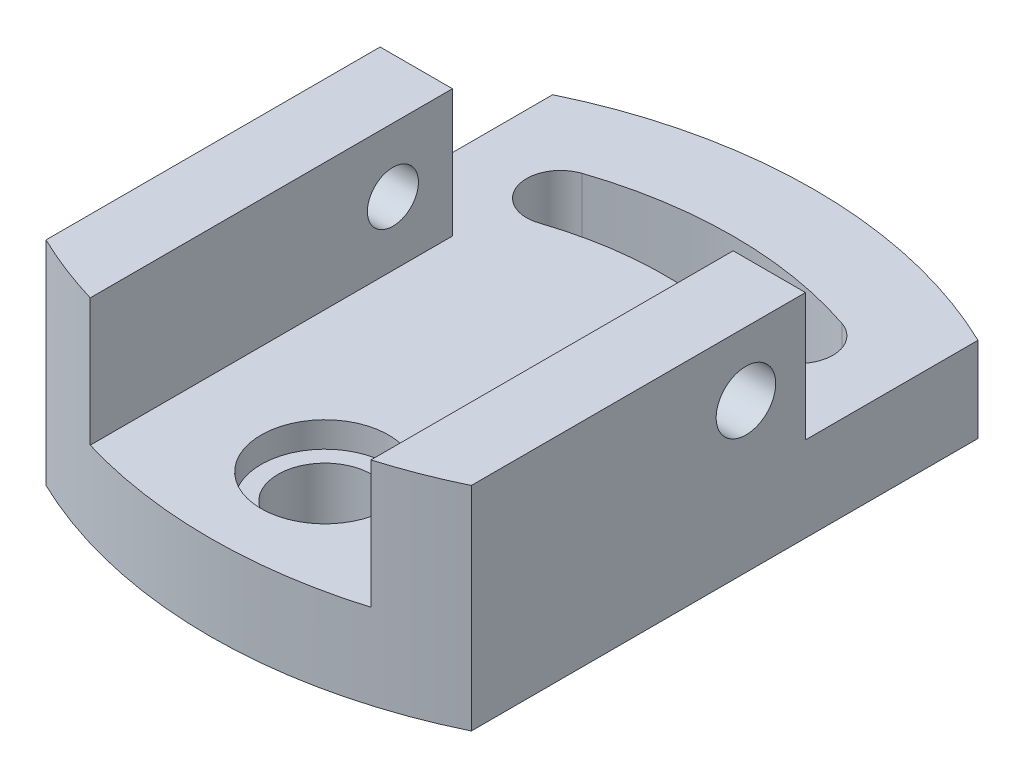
ISO-10303-21;
HEADER;
FILE_DESCRIPTION(('STEP AP214'),'2;1');
FILE_NAME('part.step','',(''),(''),'','','');
FILE_SCHEMA(('AUTOMOTIVE_DESIGN { 1 0 10303 214 1 1 1 1 }'));
ENDSEC;
DATA;
#1=APPLICATION_CONTEXT('core data for automotive mechanical design processes');
#2=APPLICATION_PROTOCOL_DEFINITION('international standard','automotive_design',2000,#1);
#3=PRODUCT_CONTEXT('',#1,'mechanical');
#4=PRODUCT('Part','Part','',(#3));
#5=PRODUCT_RELATED_PRODUCT_CATEGORY('part','',(#4));
#6=PRODUCT_DEFINITION_FORMATION('','',#4);
#7=PRODUCT_DEFINITION_CONTEXT('part definition',#1,'design');
#8=PRODUCT_DEFINITION('design','',#6,#7);
#9=PRODUCT_DEFINITION_SHAPE('','',#8);
#10=(LENGTH_UNIT() NAMED_UNIT(*) SI_UNIT(.MILLI.,.METRE.));
#11=(NAMED_UNIT(*) PLANE_ANGLE_UNIT() SI_UNIT($,.RADIAN.));
#12=(NAMED_UNIT(*) SI_UNIT($,.STERADIAN.) SOLID_ANGLE_UNIT());
#13=UNCERTAINTY_MEASURE_WITH_UNIT(LENGTH_MEASURE(1.E-05),#10,'distance_accuracy_value','');
#14=(GEOMETRIC_REPRESENTATION_CONTEXT(3) GLOBAL_UNCERTAINTY_ASSIGNED_CONTEXT((#13)) GLOBAL_UNIT_ASSIGNED_CONTEXT((#10,
#11,#12)) REPRESENTATION_CONTEXT('',''));
#15=CARTESIAN_POINT('',(0.,0.,0.));
#16=DIRECTION('',(0.,0.,1.));
#17=DIRECTION('',(1.,0.,0.));
#18=AXIS2_PLACEMENT_3D('',#15,#16,#17);
#19=CARTESIAN_POINT('',(-33.,20.,-71.001));
#20=DIRECTION('',(0.,-1.,0.));
#21=DIRECTION('',(0.,0.,-1.));
#22=AXIS2_PLACEMENT_3D('',#19,#20,#21);
#23=PLANE('',#22);
#24=DIRECTION('',(0.,0.,1.));
#25=VECTOR('',#24,1.);
#26=CARTESIAN_POINT('',(-33.,20.,-71.001));
#27=LINE('',#26,#25);
#28=CARTESIAN_POINT('',(-33.,20.,-19.));
#29=VERTEX_POINT('',#28);
#30=CARTESIAN_POINT('',(-33.,20.,66.1635148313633));
#31=VERTEX_POINT('',#30);
#32=EDGE_CURVE('E275',#29,#31,#27,.T.);
#33=ORIENTED_EDGE('',*,*,#32,.T.);
#34=CARTESIAN_POINT('',(0.,20.,-44.));
#35=DIRECTION('',(0.,-1.,0.));
#36=DIRECTION('',(0.,0.,-1.));
#37=AXIS2_PLACEMENT_3D('',#34,#35,#36);
#38=CIRCLE('',#37,115.);
#39=CARTESIAN_POINT('',(33.,20.,66.1635148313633));
#40=VERTEX_POINT('',#39);
#41=EDGE_CURVE('E214',#40,#31,#38,.T.);
#42=ORIENTED_EDGE('',*,*,#41,.F.);
#43=DIRECTION('',(0.,0.,1.));
#44=VECTOR('',#43,1.);
#45=CARTESIAN_POINT('',(33.,20.,-71.001));
#46=LINE('',#45,#44);
#47=CARTESIAN_POINT('',(33.,20.,-19.));
#48=VERTEX_POINT('',#47);
#49=EDGE_CURVE('E279',#48,#40,#46,.T.);
#50=ORIENTED_EDGE('',*,*,#49,.F.);
#51=DIRECTION('',(1.,0.,0.));
#52=VECTOR('',#51,1.);
#53=CARTESIAN_POINT('',(-50.,20.,-19.));
#54=LINE('',#53,#52);
#55=CARTESIAN_POINT('',(50.,20.,-19.));
#56=VERTEX_POINT('',#55);
#57=EDGE_CURVE('E256',#48,#56,#54,.T.);
#58=ORIENTED_EDGE('',*,*,#57,.T.);
#59=DIRECTION('',(0.,0.,-1.));
#60=VECTOR('',#59,1.);
#61=CARTESIAN_POINT('',(50.,20.,-71.));
#62=LINE('',#61,#60);
#63=CARTESIAN_POINT('',(50.,20.,-59.5615758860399));
#64=VERTEX_POINT('',#63);
#65=EDGE_CURVE('E264',#56,#64,#62,.T.);
#66=ORIENTED_EDGE('',*,*,#65,.T.);
#67=CARTESIAN_POINT('',(0.,20.,44.));
#68=DIRECTION('',(0.,-1.,0.));
#69=DIRECTION('',(0.,0.,-1.));
#70=AXIS2_PLACEMENT_3D('',#67,#68,#69);
#71=CIRCLE('',#70,115.);
#72=CARTESIAN_POINT('',(-50.,20.,-59.5615758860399));
#73=VERTEX_POINT('',#72);
#74=EDGE_CURVE('E184',#64,#73,#71,.F.);
#75=ORIENTED_EDGE('',*,*,#74,.T.);
#76=DIRECTION('',(0.,0.,1.));
#77=VECTOR('',#76,1.);
#78=CARTESIAN_POINT('',(-50.,20.,-71.));
#79=LINE('',#78,#77);
#80=CARTESIAN_POINT('',(-50.,20.,-19.));
#81=VERTEX_POINT('',#80);
#82=EDGE_CURVE('E261',#73,#81,#79,.T.);
#83=ORIENTED_EDGE('',*,*,#82,.T.);
#84=EDGE_CURVE('E257',#81,#29,#54,.T.);
#85=ORIENTED_EDGE('',*,*,#84,.T.);
#86=EDGE_LOOP('',(#33,#42,#50,#58,#66,#75,#83,#85));
#87=FACE_BOUND('',#86,.T.);
#88=CARTESIAN_POINT('',(0.,20.,44.));
#89=DIRECTION('',(0.,1.,0.));
#90=DIRECTION('',(0.,0.,1.));
#91=AXIS2_PLACEMENT_3D('',#88,#89,#90);
#92=CIRCLE('',#91,96.);
#93=CARTESIAN_POINT('',(30.5454545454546,20.,-47.0108521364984));
#94=VERTEX_POINT('',#93);
#95=CARTESIAN_POINT('',(-30.5454545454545,20.,-47.0108521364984));
#96=VERTEX_POINT('',#95);
#97=EDGE_CURVE('E232',#94,#96,#92,.T.);
#98=ORIENTED_EDGE('',*,*,#97,.F.);
#99=CARTESIAN_POINT('',(28.,20.,-39.4266144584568));
#100=DIRECTION('',(0.,1.,0.));
#101=DIRECTION('',(0.,0.,1.));
#102=AXIS2_PLACEMENT_3D('',#99,#100,#101);
#103=CIRCLE('',#102,8.00000000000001);
#104=CARTESIAN_POINT('',(25.4545454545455,20.,-31.8423767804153));
#105=VERTEX_POINT('',#104);
#106=EDGE_CURVE('E230',#105,#94,#103,.T.);
#107=ORIENTED_EDGE('',*,*,#106,.F.);
#108=CARTESIAN_POINT('',(0.,20.,44.));
#109=DIRECTION('',(0.,-1.,0.));
#110=DIRECTION('',(0.,0.,1.));
#111=AXIS2_PLACEMENT_3D('',#108,#109,#110);
#112=CIRCLE('',#111,80.);
#113=CARTESIAN_POINT('',(-25.4545454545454,20.,-31.8423767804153));
#114=VERTEX_POINT('',#113);
#115=EDGE_CURVE('E238',#114,#105,#112,.T.);
#116=ORIENTED_EDGE('',*,*,#115,.F.);
#117=CARTESIAN_POINT('',(-28.,20.,-39.4266144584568));
#118=DIRECTION('',(0.,1.,0.));
#119=DIRECTION('',(0.,0.,1.));
#120=AXIS2_PLACEMENT_3D('',#117,#118,#119);
#121=CIRCLE('',#120,8.00000000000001);
#122=EDGE_CURVE('E235',#96,#114,#121,.T.);
#123=ORIENTED_EDGE('',*,*,#122,.F.);
#124=EDGE_LOOP('',(#98,#107,#116,#123));
#125=FACE_BOUND('',#124,.T.);
#126=CARTESIAN_POINT('',(0.,20.,44.));
#127=DIRECTION('',(0.,1.,0.));
#128=DIRECTION('',(0.,0.,1.));
#129=AXIS2_PLACEMENT_3D('',#126,#127,#128);
#130=CIRCLE('',#129,15.);
#131=CARTESIAN_POINT('',(0.,20.,59.));
#132=VERTEX_POINT('',#131);
#133=EDGE_CURVE('E188',#132,#132,#130,.T.);
#134=ORIENTED_EDGE('',*,*,#133,.F.);
#135=EDGE_LOOP('',(#134));
#136=FACE_BOUND('',#135,.T.);
#137=ADVANCED_FACE('F51',(#87,#125,#136),#23,.F.);
#138=CARTESIAN_POINT('',(0.,0.,0.));
#139=DIRECTION('',(0.,1.,0.));
#140=DIRECTION('',(0.,0.,1.));
#141=AXIS2_PLACEMENT_3D('',#138,#139,#140);
#142=PLANE('',#141);
#143=CARTESIAN_POINT('',(0.,0.,44.));
#144=DIRECTION('',(0.,1.,0.));
#145=DIRECTION('',(0.,0.,1.));
#146=AXIS2_PLACEMENT_3D('',#143,#144,#145);
#147=CIRCLE('',#146,11.);
#148=CARTESIAN_POINT('',(0.,0.,55.));
#149=VERTEX_POINT('',#148);
#150=EDGE_CURVE('E208',#149,#149,#147,.T.);
#151=ORIENTED_EDGE('',*,*,#150,.T.);
#152=EDGE_LOOP('',(#151));
#153=FACE_BOUND('',#152,.T.);
#154=CARTESIAN_POINT('',(0.,0.,44.));
#155=DIRECTION('',(0.,1.,0.));
#156=DIRECTION('',(0.,0.,1.));
#157=AXIS2_PLACEMENT_3D('',#154,#155,#156);
#158=CIRCLE('',#157,80.);
#159=CARTESIAN_POINT('',(25.4545454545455,0.,-31.8423767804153));
#160=VERTEX_POINT('',#159);
#161=CARTESIAN_POINT('',(-25.4545454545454,0.,-31.8423767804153));
#162=VERTEX_POINT('',#161);
#163=EDGE_CURVE('E224',#160,#162,#158,.T.);
#164=ORIENTED_EDGE('',*,*,#163,.F.);
#165=CARTESIAN_POINT('',(28.,0.,-39.4266144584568));
#166=DIRECTION('',(0.,1.,0.));
#167=DIRECTION('',(0.,0.,1.));
#168=AXIS2_PLACEMENT_3D('',#165,#166,#167);
#169=CIRCLE('',#168,8.00000000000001);
#170=CARTESIAN_POINT('',(30.5454545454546,0.,-47.0108521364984));
#171=VERTEX_POINT('',#170);
#172=EDGE_CURVE('E227',#171,#160,#169,.F.);
#173=ORIENTED_EDGE('',*,*,#172,.F.);
#174=CARTESIAN_POINT('',(0.,0.,44.));
#175=DIRECTION('',(0.,1.,0.));
#176=DIRECTION('',(0.,0.,1.));
#177=AXIS2_PLACEMENT_3D('',#174,#175,#176);
#178=CIRCLE('',#177,96.);
#179=CARTESIAN_POINT('',(-30.5454545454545,0.,-47.0108521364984));
#180=VERTEX_POINT('',#179);
#181=EDGE_CURVE('E244',#180,#171,#178,.F.);
#182=ORIENTED_EDGE('',*,*,#181,.F.);
#183=CARTESIAN_POINT('',(-28.,0.,-39.4266144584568));
#184=DIRECTION('',(0.,1.,0.));
#185=DIRECTION('',(0.,0.,1.));
#186=AXIS2_PLACEMENT_3D('',#183,#184,#185);
#187=CIRCLE('',#186,8.00000000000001);
#188=EDGE_CURVE('E222',#162,#180,#187,.F.);
#189=ORIENTED_EDGE('',*,*,#188,.F.);
#190=EDGE_LOOP('',(#164,#173,#182,#189));
#191=FACE_BOUND('',#190,.T.);
#192=CARTESIAN_POINT('',(0.,0.,-44.));
#193=DIRECTION('',(0.,1.,0.));
#194=DIRECTION('',(0.,0.,1.));
#195=AXIS2_PLACEMENT_3D('',#192,#193,#194);
#196=CIRCLE('',#195,115.);
#197=CARTESIAN_POINT('',(-50.,0.,59.5615758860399));
#198=VERTEX_POINT('',#197);
#199=CARTESIAN_POINT('',(50.,0.,59.5615758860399));
#200=VERTEX_POINT('',#199);
#201=EDGE_CURVE('E153',#198,#200,#196,.T.);
#202=ORIENTED_EDGE('',*,*,#201,.F.);
#203=DIRECTION('',(0.,0.,1.));
#204=VECTOR('',#203,1.);
#205=CARTESIAN_POINT('',(-50.,0.,71.));
#206=LINE('',#205,#204);
#207=CARTESIAN_POINT('',(-50.,0.,-59.5615758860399));
#208=VERTEX_POINT('',#207);
#209=EDGE_CURVE('E158',#208,#198,#206,.T.);
#210=ORIENTED_EDGE('',*,*,#209,.F.);
#211=CARTESIAN_POINT('',(0.,0.,44.));
#212=DIRECTION('',(0.,1.,0.));
#213=DIRECTION('',(0.,0.,1.));
#214=AXIS2_PLACEMENT_3D('',#211,#212,#213);
#215=CIRCLE('',#214,115.);
#216=CARTESIAN_POINT('',(50.,0.,-59.5615758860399));
#217=VERTEX_POINT('',#216);
#218=EDGE_CURVE('E219',#208,#217,#215,.F.);
#219=ORIENTED_EDGE('',*,*,#218,.T.);
#220=DIRECTION('',(0.,0.,-1.));
#221=VECTOR('',#220,1.);
#222=CARTESIAN_POINT('',(50.,0.,71.));
#223=LINE('',#222,#221);
#224=EDGE_CURVE('E159',#200,#217,#223,.T.);
#225=ORIENTED_EDGE('',*,*,#224,.F.);
#226=EDGE_LOOP('',(#202,#210,#219,#225));
#227=FACE_BOUND('',#226,.T.);
#228=ADVANCED_FACE('F155',(#153,#191,#227),#142,.F.);
#229=CARTESIAN_POINT('',(0.,50.,0.));
#230=DIRECTION('',(0.,1.,0.));
#231=DIRECTION('',(0.,0.,1.));
#232=AXIS2_PLACEMENT_3D('',#229,#230,#231);
#233=PLANE('',#232);
#234=DIRECTION('',(0.,0.,1.));
#235=VECTOR('',#234,1.);
#236=CARTESIAN_POINT('',(-50.,50.,71.));
#237=LINE('',#236,#235);
#238=CARTESIAN_POINT('',(-50.,50.,-19.));
#239=VERTEX_POINT('',#238);
#240=CARTESIAN_POINT('',(-50.,50.,59.5615758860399));
#241=VERTEX_POINT('',#240);
#242=EDGE_CURVE('E175',#239,#241,#237,.T.);
#243=ORIENTED_EDGE('',*,*,#242,.T.);
#244=CARTESIAN_POINT('',(0.,50.,-44.));
#245=DIRECTION('',(0.,1.,0.));
#246=DIRECTION('',(0.,0.,1.));
#247=AXIS2_PLACEMENT_3D('',#244,#245,#246);
#248=CIRCLE('',#247,115.);
#249=CARTESIAN_POINT('',(-33.,50.,66.1635148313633));
#250=VERTEX_POINT('',#249);
#251=EDGE_CURVE('E167',#241,#250,#248,.T.);
#252=ORIENTED_EDGE('',*,*,#251,.T.);
#253=DIRECTION('',(0.,0.,1.));
#254=VECTOR('',#253,1.);
#255=CARTESIAN_POINT('',(-33.,50.,-71.001));
#256=LINE('',#255,#254);
#257=CARTESIAN_POINT('',(-33.,50.,-19.));
#258=VERTEX_POINT('',#257);
#259=EDGE_CURVE('E173',#258,#250,#256,.T.);
#260=ORIENTED_EDGE('',*,*,#259,.F.);
#261=DIRECTION('',(1.,0.,0.));
#262=VECTOR('',#261,1.);
#263=CARTESIAN_POINT('',(-50.,50.,-19.));
#264=LINE('',#263,#262);
#265=EDGE_CURVE('E254',#239,#258,#264,.T.);
#266=ORIENTED_EDGE('',*,*,#265,.F.);
#267=EDGE_LOOP('',(#243,#252,#260,#266));
#268=FACE_BOUND('',#267,.T.);
#269=ADVANCED_FACE('F310',(#268),#233,.T.);
#270=CARTESIAN_POINT('',(-50.,50.,71.));
#271=DIRECTION('',(1.,0.,0.));
#272=DIRECTION('',(0.,0.,-1.));
#273=AXIS2_PLACEMENT_3D('',#270,#271,#272);
#274=PLANE('',#273);
#275=CARTESIAN_POINT('',(-50.,35.,-5.));
#276=DIRECTION('',(-1.,0.,0.));
#277=DIRECTION('',(0.,0.,1.));
#278=AXIS2_PLACEMENT_3D('',#275,#276,#277);
#279=CIRCLE('',#278,6.);
#280=CARTESIAN_POINT('',(-50.,35.,0.999999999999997));
#281=VERTEX_POINT('',#280);
#282=EDGE_CURVE('E200',#281,#281,#279,.T.);
#283=ORIENTED_EDGE('',*,*,#282,.F.);
#284=EDGE_LOOP('',(#283));
#285=FACE_BOUND('',#284,.T.);
#286=DIRECTION('',(0.,1.,0.));
#287=VECTOR('',#286,1.);
#288=CARTESIAN_POINT('',(-50.,0.,59.5615758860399));
#289=LINE('',#288,#287);
#290=EDGE_CURVE('E164',#198,#241,#289,.T.);
#291=ORIENTED_EDGE('',*,*,#290,.T.);
#292=ORIENTED_EDGE('',*,*,#242,.F.);
#293=DIRECTION('',(0.,1.,0.));
#294=VECTOR('',#293,1.);
#295=CARTESIAN_POINT('',(-50.,-92.712022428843,-19.));
#296=LINE('',#295,#294);
#297=EDGE_CURVE('E263',#81,#239,#296,.T.);
#298=ORIENTED_EDGE('',*,*,#297,.F.);
#299=ORIENTED_EDGE('',*,*,#82,.F.);
#300=DIRECTION('',(0.,1.,0.));
#301=VECTOR('',#300,1.);
#302=CARTESIAN_POINT('',(-50.,0.,-59.5615758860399));
#303=LINE('',#302,#301);
#304=EDGE_CURVE('E76',#208,#73,#303,.T.);
#305=ORIENTED_EDGE('',*,*,#304,.F.);
#306=ORIENTED_EDGE('',*,*,#209,.T.);
#307=EDGE_LOOP('',(#291,#292,#298,#299,#305,#306));
#308=FACE_BOUND('',#307,.T.);
#309=ADVANCED_FACE('F53',(#285,#308),#274,.F.);
#310=CARTESIAN_POINT('',(-33.,50.,-71.001));
#311=DIRECTION('',(-1.,0.,0.));
#312=DIRECTION('',(0.,-1.,0.));
#313=AXIS2_PLACEMENT_3D('',#310,#311,#312);
#314=PLANE('',#313);
#315=CARTESIAN_POINT('',(-33.,35.,-5.));
#316=DIRECTION('',(-1.,0.,0.));
#317=DIRECTION('',(0.,-1.,0.));
#318=AXIS2_PLACEMENT_3D('',#315,#316,#317);
#319=CIRCLE('',#318,6.);
#320=CARTESIAN_POINT('',(-33.,29.,-5.));
#321=VERTEX_POINT('',#320);
#322=EDGE_CURVE('E55',#321,#321,#319,.T.);
#323=ORIENTED_EDGE('',*,*,#322,.T.);
#324=EDGE_LOOP('',(#323));
#325=FACE_BOUND('',#324,.T.);
#326=DIRECTION('',(0.,1.,0.));
#327=VECTOR('',#326,1.);
#328=CARTESIAN_POINT('',(-33.,0.,66.1635148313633));
#329=LINE('',#328,#327);
#330=EDGE_CURVE('E12',#31,#250,#329,.T.);
#331=ORIENTED_EDGE('',*,*,#330,.F.);
#332=ORIENTED_EDGE('',*,*,#32,.F.);
#333=DIRECTION('',(0.,1.,0.));
#334=VECTOR('',#333,1.);
#335=CARTESIAN_POINT('',(-33.,50.,-19.));
#336=LINE('',#335,#334);
#337=EDGE_CURVE('E273',#29,#258,#336,.T.);
#338=ORIENTED_EDGE('',*,*,#337,.T.);
#339=ORIENTED_EDGE('',*,*,#259,.T.);
#340=EDGE_LOOP('',(#331,#332,#338,#339));
#341=FACE_BOUND('',#340,.T.);
#342=ADVANCED_FACE('F308',(#325,#341),#314,.F.);
#343=CARTESIAN_POINT('',(50.,50.,71.));
#344=DIRECTION('',(-1.,0.,0.));
#345=DIRECTION('',(0.,0.,1.));
#346=AXIS2_PLACEMENT_3D('',#343,#344,#345);
#347=PLANE('',#346);
#348=CARTESIAN_POINT('',(50.,35.,-5.));
#349=DIRECTION('',(1.,0.,0.));
#350=DIRECTION('',(0.,0.,-1.));
#351=AXIS2_PLACEMENT_3D('',#348,#349,#350);
#352=CIRCLE('',#351,7.);
#353=CARTESIAN_POINT('',(50.,35.,-12.));
#354=VERTEX_POINT('',#353);
#355=EDGE_CURVE('E189',#354,#354,#352,.T.);
#356=ORIENTED_EDGE('',*,*,#355,.F.);
#357=EDGE_LOOP('',(#356));
#358=FACE_BOUND('',#357,.T.);
#359=DIRECTION('',(0.,1.,0.));
#360=VECTOR('',#359,1.);
#361=CARTESIAN_POINT('',(50.,0.,59.5615758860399));
#362=LINE('',#361,#360);
#363=CARTESIAN_POINT('',(50.,50.,59.5615758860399));
#364=VERTEX_POINT('',#363);
#365=EDGE_CURVE('E161',#200,#364,#362,.T.);
#366=ORIENTED_EDGE('',*,*,#365,.F.);
#367=ORIENTED_EDGE('',*,*,#224,.T.);
#368=DIRECTION('',(0.,1.,0.));
#369=VECTOR('',#368,1.);
#370=CARTESIAN_POINT('',(50.,0.,-59.5615758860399));
#371=LINE('',#370,#369);
#372=EDGE_CURVE('E216',#217,#64,#371,.T.);
#373=ORIENTED_EDGE('',*,*,#372,.T.);
#374=ORIENTED_EDGE('',*,*,#65,.F.);
#375=DIRECTION('',(0.,1.,0.));
#376=VECTOR('',#375,1.);
#377=CARTESIAN_POINT('',(50.,-92.712022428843,-19.));
#378=LINE('',#377,#376);
#379=CARTESIAN_POINT('',(50.,50.,-19.));
#380=VERTEX_POINT('',#379);
#381=EDGE_CURVE('E260',#56,#380,#378,.T.);
#382=ORIENTED_EDGE('',*,*,#381,.T.);
#383=DIRECTION('',(0.,0.,-1.));
#384=VECTOR('',#383,1.);
#385=CARTESIAN_POINT('',(50.,50.,71.));
#386=LINE('',#385,#384);
#387=EDGE_CURVE('E181',#364,#380,#386,.T.);
#388=ORIENTED_EDGE('',*,*,#387,.F.);
#389=EDGE_LOOP('',(#366,#367,#373,#374,#382,#388));
#390=FACE_BOUND('',#389,.T.);
#391=ADVANCED_FACE('F296',(#358,#390),#347,.F.);
#392=DIRECTION('',(0.,0.,1.));
#393=VECTOR('',#392,1.);
#394=CARTESIAN_POINT('',(33.,50.,-71.001));
#395=LINE('',#394,#393);
#396=CARTESIAN_POINT('',(33.,50.,-19.));
#397=VERTEX_POINT('',#396);
#398=CARTESIAN_POINT('',(33.,50.,66.1635148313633));
#399=VERTEX_POINT('',#398);
#400=EDGE_CURVE('E178',#397,#399,#395,.T.);
#401=ORIENTED_EDGE('',*,*,#400,.T.);
#402=CARTESIAN_POINT('',(0.,50.,-44.));
#403=DIRECTION('',(0.,1.,0.));
#404=DIRECTION('',(0.,0.,1.));
#405=AXIS2_PLACEMENT_3D('',#402,#403,#404);
#406=CIRCLE('',#405,115.);
#407=EDGE_CURVE('E68',#399,#364,#406,.T.);
#408=ORIENTED_EDGE('',*,*,#407,.T.);
#409=ORIENTED_EDGE('',*,*,#387,.T.);
#410=EDGE_CURVE('E253',#397,#380,#264,.T.);
#411=ORIENTED_EDGE('',*,*,#410,.F.);
#412=EDGE_LOOP('',(#401,#408,#409,#411));
#413=FACE_BOUND('',#412,.T.);
#414=ADVANCED_FACE('F289',(#413),#233,.T.);
#415=CARTESIAN_POINT('',(33.,50.,-71.001));
#416=DIRECTION('',(1.,0.,0.));
#417=DIRECTION('',(0.,1.,0.));
#418=AXIS2_PLACEMENT_3D('',#415,#416,#417);
#419=PLANE('',#418);
#420=CARTESIAN_POINT('',(33.,35.,-5.));
#421=DIRECTION('',(1.,0.,0.));
#422=DIRECTION('',(0.,1.,0.));
#423=AXIS2_PLACEMENT_3D('',#420,#421,#422);
#424=CIRCLE('',#423,7.);
#425=CARTESIAN_POINT('',(33.,42.,-5.));
#426=VERTEX_POINT('',#425);
#427=EDGE_CURVE('E186',#426,#426,#424,.T.);
#428=ORIENTED_EDGE('',*,*,#427,.T.);
#429=EDGE_LOOP('',(#428));
#430=FACE_BOUND('',#429,.T.);
#431=DIRECTION('',(0.,1.,0.));
#432=VECTOR('',#431,1.);
#433=CARTESIAN_POINT('',(33.,0.,66.1635148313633));
#434=LINE('',#433,#432);
#435=EDGE_CURVE('E60',#399,#40,#434,.F.);
#436=ORIENTED_EDGE('',*,*,#435,.F.);
#437=ORIENTED_EDGE('',*,*,#400,.F.);
#438=DIRECTION('',(0.,-1.,0.));
#439=VECTOR('',#438,1.);
#440=CARTESIAN_POINT('',(33.,50.,-19.));
#441=LINE('',#440,#439);
#442=EDGE_CURVE('E270',#397,#48,#441,.T.);
#443=ORIENTED_EDGE('',*,*,#442,.T.);
#444=ORIENTED_EDGE('',*,*,#49,.T.);
#445=EDGE_LOOP('',(#436,#437,#443,#444));
#446=FACE_BOUND('',#445,.T.);
#447=ADVANCED_FACE('F303',(#430,#446),#419,.F.);
#448=CARTESIAN_POINT('',(-50.,-92.712022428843,-19.));
#449=DIRECTION('',(0.,0.,1.));
#450=DIRECTION('',(1.,0.,0.));
#451=AXIS2_PLACEMENT_3D('',#448,#449,#450);
#452=PLANE('',#451);
#453=ORIENTED_EDGE('',*,*,#410,.T.);
#454=ORIENTED_EDGE('',*,*,#381,.F.);
#455=ORIENTED_EDGE('',*,*,#57,.F.);
#456=ORIENTED_EDGE('',*,*,#442,.F.);
#457=EDGE_LOOP('',(#453,#454,#455,#456));
#458=FACE_BOUND('',#457,.T.);
#459=ADVANCED_FACE('F294',(#458),#452,.F.);
#460=ORIENTED_EDGE('',*,*,#84,.F.);
#461=ORIENTED_EDGE('',*,*,#297,.T.);
#462=ORIENTED_EDGE('',*,*,#265,.T.);
#463=ORIENTED_EDGE('',*,*,#337,.F.);
#464=EDGE_LOOP('',(#460,#461,#462,#463));
#465=FACE_BOUND('',#464,.T.);
#466=ADVANCED_FACE('F313',(#465),#452,.F.);
#467=CARTESIAN_POINT('',(28.,-0.001000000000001,-39.4266144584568));
#468=DIRECTION('',(0.,1.,0.));
#469=DIRECTION('',(0.,0.,1.));
#470=AXIS2_PLACEMENT_3D('',#467,#468,#469);
#471=CYLINDRICAL_SURFACE('',#470,8.00000000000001);
#472=ORIENTED_EDGE('',*,*,#172,.T.);
#473=DIRECTION('',(0.,1.,0.));
#474=VECTOR('',#473,1.);
#475=CARTESIAN_POINT('',(25.4545454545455,-0.001000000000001,-31.8423767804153));
#476=LINE('',#475,#474);
#477=EDGE_CURVE('E242',#160,#105,#476,.T.);
#478=ORIENTED_EDGE('',*,*,#477,.T.);
#479=ORIENTED_EDGE('',*,*,#106,.T.);
#480=DIRECTION('',(0.,1.,0.));
#481=VECTOR('',#480,1.);
#482=CARTESIAN_POINT('',(30.5454545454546,-0.001000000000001,-47.0108521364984));
#483=LINE('',#482,#481);
#484=EDGE_CURVE('E241',#171,#94,#483,.T.);
#485=ORIENTED_EDGE('',*,*,#484,.F.);
#486=EDGE_LOOP('',(#472,#478,#479,#485));
#487=FACE_BOUND('',#486,.T.);
#488=ADVANCED_FACE('F315',(#487),#471,.F.);
#489=CARTESIAN_POINT('',(0.,-0.001000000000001,44.));
#490=DIRECTION('',(0.,1.,0.));
#491=DIRECTION('',(0.,0.,1.));
#492=AXIS2_PLACEMENT_3D('',#489,#490,#491);
#493=CYLINDRICAL_SURFACE('',#492,80.);
#494=ORIENTED_EDGE('',*,*,#163,.T.);
#495=DIRECTION('',(0.,1.,0.));
#496=VECTOR('',#495,1.);
#497=CARTESIAN_POINT('',(-25.4545454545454,-0.001000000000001,-31.8423767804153));
#498=LINE('',#497,#496);
#499=EDGE_CURVE('E245',#162,#114,#498,.T.);
#500=ORIENTED_EDGE('',*,*,#499,.T.);
#501=ORIENTED_EDGE('',*,*,#115,.T.);
#502=ORIENTED_EDGE('',*,*,#477,.F.);
#503=EDGE_LOOP('',(#494,#500,#501,#502));
#504=FACE_BOUND('',#503,.T.);
#505=ADVANCED_FACE('F321',(#504),#493,.T.);
#506=CARTESIAN_POINT('',(-28.,-0.001000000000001,-39.4266144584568));
#507=DIRECTION('',(0.,1.,0.));
#508=DIRECTION('',(0.,0.,1.));
#509=AXIS2_PLACEMENT_3D('',#506,#507,#508);
#510=CYLINDRICAL_SURFACE('',#509,8.00000000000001);
#511=ORIENTED_EDGE('',*,*,#188,.T.);
#512=DIRECTION('',(0.,1.,0.));
#513=VECTOR('',#512,1.);
#514=CARTESIAN_POINT('',(-30.5454545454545,-0.001000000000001,-47.0108521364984));
#515=LINE('',#514,#513);
#516=EDGE_CURVE('E247',#180,#96,#515,.T.);
#517=ORIENTED_EDGE('',*,*,#516,.T.);
#518=ORIENTED_EDGE('',*,*,#122,.T.);
#519=ORIENTED_EDGE('',*,*,#499,.F.);
#520=EDGE_LOOP('',(#511,#517,#518,#519));
#521=FACE_BOUND('',#520,.T.);
#522=ADVANCED_FACE('F380',(#521),#510,.F.);
#523=CARTESIAN_POINT('',(0.,-0.001000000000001,44.));
#524=DIRECTION('',(0.,1.,0.));
#525=DIRECTION('',(0.,0.,1.));
#526=AXIS2_PLACEMENT_3D('',#523,#524,#525);
#527=CYLINDRICAL_SURFACE('',#526,96.);
#528=ORIENTED_EDGE('',*,*,#181,.T.);
#529=ORIENTED_EDGE('',*,*,#484,.T.);
#530=ORIENTED_EDGE('',*,*,#97,.T.);
#531=ORIENTED_EDGE('',*,*,#516,.F.);
#532=EDGE_LOOP('',(#528,#529,#530,#531));
#533=FACE_BOUND('',#532,.T.);
#534=ADVANCED_FACE('F390',(#533),#527,.F.);
#535=CARTESIAN_POINT('',(0.,0.,44.));
#536=DIRECTION('',(0.,1.,0.));
#537=DIRECTION('',(0.,0.,1.));
#538=AXIS2_PLACEMENT_3D('',#535,#536,#537);
#539=CYLINDRICAL_SURFACE('',#538,115.);
#540=ORIENTED_EDGE('',*,*,#74,.F.);
#541=ORIENTED_EDGE('',*,*,#372,.F.);
#542=ORIENTED_EDGE('',*,*,#218,.F.);
#543=ORIENTED_EDGE('',*,*,#304,.T.);
#544=EDGE_LOOP('',(#540,#541,#542,#543));
#545=FACE_BOUND('',#544,.T.);
#546=ADVANCED_FACE('F399',(#545),#539,.T.);
#547=CARTESIAN_POINT('',(0.,0.,-44.));
#548=DIRECTION('',(0.,1.,0.));
#549=DIRECTION('',(0.,0.,1.));
#550=AXIS2_PLACEMENT_3D('',#547,#548,#549);
#551=CYLINDRICAL_SURFACE('',#550,115.);
#552=ORIENTED_EDGE('',*,*,#41,.T.);
#553=ORIENTED_EDGE('',*,*,#330,.T.);
#554=ORIENTED_EDGE('',*,*,#251,.F.);
#555=ORIENTED_EDGE('',*,*,#290,.F.);
#556=ORIENTED_EDGE('',*,*,#201,.T.);
#557=ORIENTED_EDGE('',*,*,#365,.T.);
#558=ORIENTED_EDGE('',*,*,#407,.F.);
#559=ORIENTED_EDGE('',*,*,#435,.T.);
#560=EDGE_LOOP('',(#552,#553,#554,#555,#556,#557,#558,#559));
#561=FACE_BOUND('',#560,.T.);
#562=ADVANCED_FACE('F165',(#561),#551,.T.);
#563=CARTESIAN_POINT('',(0.,20.,44.));
#564=DIRECTION('',(0.,1.,0.));
#565=DIRECTION('',(0.,0.,1.));
#566=AXIS2_PLACEMENT_3D('',#563,#564,#565);
#567=CYLINDRICAL_SURFACE('',#566,11.);
#568=ORIENTED_EDGE('',*,*,#150,.F.);
#569=EDGE_LOOP('',(#568));
#570=FACE_BOUND('',#569,.T.);
#571=CARTESIAN_POINT('',(0.,14.,44.));
#572=DIRECTION('',(0.,1.,0.));
#573=DIRECTION('',(0.,0.,1.));
#574=AXIS2_PLACEMENT_3D('',#571,#572,#573);
#575=CIRCLE('',#574,11.);
#576=CARTESIAN_POINT('',(0.,14.,55.));
#577=VERTEX_POINT('',#576);
#578=EDGE_CURVE('E205',#577,#577,#575,.T.);
#579=ORIENTED_EDGE('',*,*,#578,.T.);
#580=EDGE_LOOP('',(#579));
#581=FACE_BOUND('',#580,.T.);
#582=ADVANCED_FACE('F454',(#570,#581),#567,.F.);
#583=CARTESIAN_POINT('',(11.,14.,44.));
#584=DIRECTION('',(0.,-1.,0.));
#585=DIRECTION('',(0.,0.,-1.));
#586=AXIS2_PLACEMENT_3D('',#583,#584,#585);
#587=PLANE('',#586);
#588=ORIENTED_EDGE('',*,*,#578,.F.);
#589=EDGE_LOOP('',(#588));
#590=FACE_BOUND('',#589,.T.);
#591=CARTESIAN_POINT('',(0.,14.,44.));
#592=DIRECTION('',(0.,1.,0.));
#593=DIRECTION('',(0.,0.,1.));
#594=AXIS2_PLACEMENT_3D('',#591,#592,#593);
#595=CIRCLE('',#594,15.);
#596=CARTESIAN_POINT('',(0.,14.,59.));
#597=VERTEX_POINT('',#596);
#598=EDGE_CURVE('E193',#597,#597,#595,.T.);
#599=ORIENTED_EDGE('',*,*,#598,.T.);
#600=EDGE_LOOP('',(#599));
#601=FACE_BOUND('',#600,.T.);
#602=ADVANCED_FACE('F446',(#590,#601),#587,.F.);
#603=CARTESIAN_POINT('',(0.,20.,44.));
#604=DIRECTION('',(0.,1.,0.));
#605=DIRECTION('',(0.,0.,1.));
#606=AXIS2_PLACEMENT_3D('',#603,#604,#605);
#607=CYLINDRICAL_SURFACE('',#606,15.);
#608=ORIENTED_EDGE('',*,*,#598,.F.);
#609=EDGE_LOOP('',(#608));
#610=FACE_BOUND('',#609,.T.);
#611=ORIENTED_EDGE('',*,*,#133,.T.);
#612=EDGE_LOOP('',(#611));
#613=FACE_BOUND('',#612,.T.);
#614=ADVANCED_FACE('F442',(#610,#613),#607,.F.);
#615=CARTESIAN_POINT('',(0.,35.,-5.));
#616=DIRECTION('',(1.,0.,0.));
#617=DIRECTION('',(0.,0.,-1.));
#618=AXIS2_PLACEMENT_3D('',#615,#616,#617);
#619=CYLINDRICAL_SURFACE('',#618,7.);
#620=ORIENTED_EDGE('',*,*,#355,.T.);
#621=EDGE_LOOP('',(#620));
#622=FACE_BOUND('',#621,.T.);
#623=ORIENTED_EDGE('',*,*,#427,.F.);
#624=EDGE_LOOP('',(#623));
#625=FACE_BOUND('',#624,.T.);
#626=ADVANCED_FACE('F423',(#622,#625),#619,.F.);
#627=CARTESIAN_POINT('',(0.,35.,-5.));
#628=DIRECTION('',(-1.,0.,0.));
#629=DIRECTION('',(0.,0.,1.));
#630=AXIS2_PLACEMENT_3D('',#627,#628,#629);
#631=CYLINDRICAL_SURFACE('',#630,6.);
#632=ORIENTED_EDGE('',*,*,#282,.T.);
#633=EDGE_LOOP('',(#632));
#634=FACE_BOUND('',#633,.T.);
#635=ORIENTED_EDGE('',*,*,#322,.F.);
#636=EDGE_LOOP('',(#635));
#637=FACE_BOUND('',#636,.T.);
#638=ADVANCED_FACE('F431',(#634,#637),#631,.F.);
#639=CLOSED_SHELL('',(#137,#228,#269,#309,#342,#391,#414,#447,#459,#466,#488,#505,#522,#534,
#546,#562,#582,#602,#614,#626,#638));
#640=MANIFOLD_SOLID_BREP('B2',#639);
#641=ADVANCED_BREP_SHAPE_REPRESENTATION('',(#18,#640),#14);
#642=SHAPE_DEFINITION_REPRESENTATION(#9,#641);
ENDSEC;
END-ISO-10303-21;
